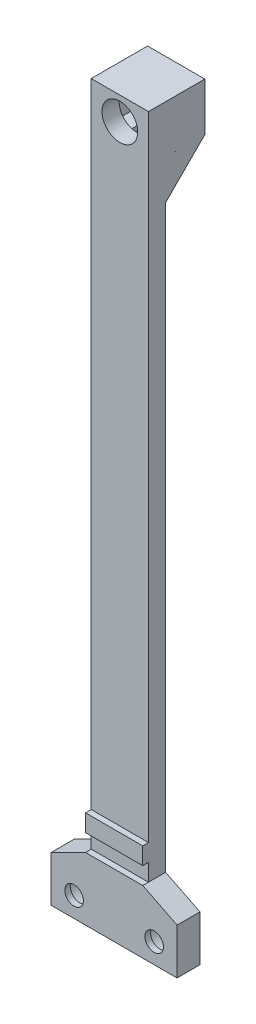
from build123d import *

# Parameters (mm, degrees)
CROQUIS1_W                   = 10
CROQUIS1_H                   = 125
SALIENTE_EXTRUIR1_DEPTH      = 3
CROQUIS2_W                   = 10
CROQUIS2_H                   = 9
CROQUIS2_H_2                 = 3
SALIENTE_EXTRUIR2_DEPTH      = 1
CROQUIS3_R                   = 3.125
CORTAR_EXTRUIR1_DEPTH        = 5
SALIENTE_EXTRUIR3_DEPTH      = 4
CROQUIS12_W                  = 22
CROQUIS12_H                  = 2
SALIENTE_EXTRUIR7_DEPTH      = 4
SALIENTE_EXTRUIR4_DEPTH      = 15
SALIENTE_EXTRUIR4_DEPTH_BACK = 3
SALIENTE_EXTRUIR5_DEPTH      = 10
CROQUIS11_W                  = 10
CROQUIS11_H                  = 8.419183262
SALIENTE_EXTRUIR6_DEPTH      = 1
CROQUIS13_R                  = 3
CORTAR_EXTRUIR2_DEPTH        = 3
CROQUIS14_R                  = 1.625
CORTAR_EXTRUIR3_DEPTH        = 4
SKETCH1_W                    = 12.266757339
SKETCH1_H                    = 12.996881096
CUT_EXTRUDE1_DEPTH           = 10


with BuildPart() as part:
    # Croquis1 → Saliente-Extruir1 (new body)
    with BuildSketch(Plane.XY):
        Rectangle(CROQUIS1_W, CROQUIS1_H)
    extrude(amount=SALIENTE_EXTRUIR1_DEPTH)

    # Croquis2 → Saliente-Extruir2 (add)
    with BuildSketch(Plane.XY.offset(3)):
        with Locations((0, -58)):
            Rectangle(CROQUIS2_W, CROQUIS2_H)
        with Locations((0, -49)):
            Rectangle(CROQUIS2_W, CROQUIS2_H_2)
    extrude(amount=SALIENTE_EXTRUIR2_DEPTH)

    # Croquis3 → Cortar-Extruir1 (cut)
    with BuildSketch(Plane.XY.offset(3)):
        with Locations((0, 59.07)):
            Circle(CROQUIS3_R)
    extrude(amount=-CORTAR_EXTRUIR1_DEPTH, mode=Mode.SUBTRACT)

    # Croquis4 → Saliente-Extruir3 (add)
    with BuildSketch(Plane(origin=(0, 0, 0), x_dir=(-1, 0, 0), z_dir=(0, 0, -1))):
        Polygon((5, -62.5), (11, -62.5), (11, -56.5), (5, -53.5), align=None)
        Polygon((-5, -53.5), (-5, -62.5), (-11, -62.5), (-11, -56.5), align=None)
    extrude(amount=-SALIENTE_EXTRUIR3_DEPTH)

    # Croquis12 → Saliente-Extruir7 (add)
    with BuildSketch(Plane.XY.offset(4)):
        with Locations((0, -63.5)):
            Rectangle(CROQUIS12_W, CROQUIS12_H)
    extrude(amount=-SALIENTE_EXTRUIR7_DEPTH)

    # Croquis8 → Saliente-Extruir4 (add, two sides: drawn at the far end of the back side and taken through both)
    with BuildSketch(Plane(origin=(0, 0, 0), x_dir=(-1, 0, 0), z_dir=(0, 0, -1)).offset(-SALIENTE_EXTRUIR4_DEPTH_BACK)):
        Polygon((-5, 63.118516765), (5, 63.118516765), (5, 54.698516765), (1.488747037, 54.698516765), (1.488747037, 55.498516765), (4.2, 55.498516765), (4.2, 62.318516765), (-4.2, 62.318516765), (-4.2, 55.499333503), (-0.940389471, 55.499333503), (-0.940389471, 54.699333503), (-5, 54.699333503), align=None)
    extrude(amount=SALIENTE_EXTRUIR4_DEPTH + SALIENTE_EXTRUIR4_DEPTH_BACK)

    # Croquis10 → Saliente-Extruir5 (add)
    with BuildSketch(Plane.ZY.offset(5)):
        Polygon((-6.847484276, 54.698516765), (0, 47.851032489), (0, 54.698516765), align=None)
    extrude(amount=-SALIENTE_EXTRUIR5_DEPTH)

    # Croquis11 → Saliente-Extruir6 (add)
    with BuildSketch(Plane(origin=(0, 0, -15), x_dir=(-1, 0, 0), z_dir=(0, 0, -1))):
        with Locations((0, 58.908925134)):
            Rectangle(CROQUIS11_W, CROQUIS11_H)
    extrude(amount=SALIENTE_EXTRUIR6_DEPTH)

    # Croquis13 → Cortar-Extruir2 (cut)
    with BuildSketch(Plane(origin=(0, 0, 0), x_dir=(-1, 0, 0), z_dir=(0, 0, -1))):
        with Locations((-7, -61)):
            Circle(CROQUIS13_R)
        with Locations((7, -61)):
            Circle(CROQUIS13_R)
    extrude(amount=-CORTAR_EXTRUIR2_DEPTH, mode=Mode.SUBTRACT)

    # Croquis14 → Cortar-Extruir3 (cut)
    with BuildSketch(Plane(origin=(0, 0, 3), x_dir=(-1, 0, 0), z_dir=(0, 0, -1))):
        with Locations((-7, -61)):
            Circle(CROQUIS14_R)
        with Locations((7, -61)):
            Circle(CROQUIS14_R)
    extrude(amount=-CORTAR_EXTRUIR3_DEPTH, mode=Mode.SUBTRACT)

    # Sketch1 → Cut-Extrude1 (cut)
    with BuildSketch(Plane(origin=(5, 0, 0), x_dir=(0, 0, -1), z_dir=(1, 0, 0))):
        with Locations((12.980862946, 58.33842935)):
            Rectangle(SKETCH1_W, SKETCH1_H)
    extrude(amount=-CUT_EXTRUDE1_DEPTH, mode=Mode.SUBTRACT)


solid = part.part
